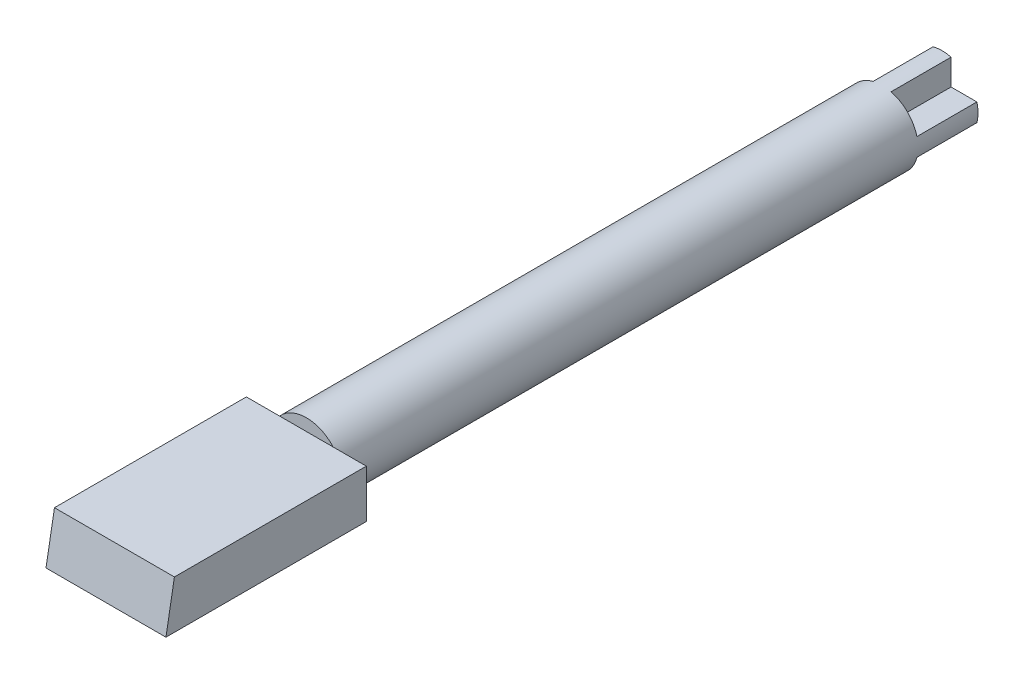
ISO-10303-21;
HEADER;
FILE_DESCRIPTION(('STEP AP214'),'2;1');
FILE_NAME('part.step','',(''),(''),'','','');
FILE_SCHEMA(('AUTOMOTIVE_DESIGN { 1 0 10303 214 1 1 1 1 }'));
ENDSEC;
DATA;
#1=APPLICATION_CONTEXT('core data for automotive mechanical design processes');
#2=APPLICATION_PROTOCOL_DEFINITION('international standard','automotive_design',2000,#1);
#3=PRODUCT_CONTEXT('',#1,'mechanical');
#4=PRODUCT('Part','Part','',(#3));
#5=PRODUCT_RELATED_PRODUCT_CATEGORY('part','',(#4));
#6=PRODUCT_DEFINITION_FORMATION('','',#4);
#7=PRODUCT_DEFINITION_CONTEXT('part definition',#1,'design');
#8=PRODUCT_DEFINITION('design','',#6,#7);
#9=PRODUCT_DEFINITION_SHAPE('','',#8);
#10=(LENGTH_UNIT() NAMED_UNIT(*) SI_UNIT(.MILLI.,.METRE.));
#11=(NAMED_UNIT(*) PLANE_ANGLE_UNIT() SI_UNIT($,.RADIAN.));
#12=(NAMED_UNIT(*) SI_UNIT($,.STERADIAN.) SOLID_ANGLE_UNIT());
#13=UNCERTAINTY_MEASURE_WITH_UNIT(LENGTH_MEASURE(1.E-05),#10,'distance_accuracy_value','');
#14=(GEOMETRIC_REPRESENTATION_CONTEXT(3) GLOBAL_UNCERTAINTY_ASSIGNED_CONTEXT((#13)) GLOBAL_UNIT_ASSIGNED_CONTEXT((#10,
#11,#12)) REPRESENTATION_CONTEXT('',''));
#15=CARTESIAN_POINT('',(0.,0.,0.));
#16=DIRECTION('',(0.,0.,1.));
#17=DIRECTION('',(1.,0.,0.));
#18=AXIS2_PLACEMENT_3D('',#15,#16,#17);
#19=CARTESIAN_POINT('',(0.,0.,0.));
#20=DIRECTION('',(0.,0.,1.));
#21=DIRECTION('',(1.,0.,0.));
#22=AXIS2_PLACEMENT_3D('',#19,#20,#21);
#23=PLANE('',#22);
#24=DIRECTION('',(0.,-1.,0.));
#25=VECTOR('',#24,1.);
#26=CARTESIAN_POINT('',(0.75,0.,0.));
#27=LINE('',#26,#25);
#28=CARTESIAN_POINT('',(0.75,-0.75,0.));
#29=VERTEX_POINT('',#28);
#30=CARTESIAN_POINT('',(0.75,-2.90473750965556,0.));
#31=VERTEX_POINT('',#30);
#32=EDGE_CURVE('E63',#29,#31,#27,.T.);
#33=ORIENTED_EDGE('',*,*,#32,.F.);
#34=DIRECTION('',(1.,0.,0.));
#35=VECTOR('',#34,1.);
#36=CARTESIAN_POINT('',(0.,-0.75,0.));
#37=LINE('',#36,#35);
#38=CARTESIAN_POINT('',(2.90473750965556,-0.75,0.));
#39=VERTEX_POINT('',#38);
#40=EDGE_CURVE('E225',#29,#39,#37,.T.);
#41=ORIENTED_EDGE('',*,*,#40,.T.);
#42=CARTESIAN_POINT('',(0.,0.,0.));
#43=DIRECTION('',(0.,0.,1.));
#44=DIRECTION('',(1.,0.,0.));
#45=AXIS2_PLACEMENT_3D('',#42,#43,#44);
#46=CIRCLE('',#45,3.);
#47=EDGE_CURVE('E284',#31,#39,#46,.T.);
#48=ORIENTED_EDGE('',*,*,#47,.F.);
#49=EDGE_LOOP('',(#33,#41,#48));
#50=FACE_BOUND('',#49,.T.);
#51=ADVANCED_FACE('F36',(#50),#23,.F.);
#52=DIRECTION('',(1.,0.,0.));
#53=VECTOR('',#52,1.);
#54=CARTESIAN_POINT('',(0.,0.75,0.));
#55=LINE('',#54,#53);
#56=CARTESIAN_POINT('',(0.75,0.75,0.));
#57=VERTEX_POINT('',#56);
#58=CARTESIAN_POINT('',(2.90473750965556,0.75,0.));
#59=VERTEX_POINT('',#58);
#60=EDGE_CURVE('E222',#57,#59,#55,.T.);
#61=ORIENTED_EDGE('',*,*,#60,.F.);
#62=DIRECTION('',(0.,-1.,0.));
#63=VECTOR('',#62,1.);
#64=CARTESIAN_POINT('',(0.75,0.,0.));
#65=LINE('',#64,#63);
#66=CARTESIAN_POINT('',(0.75,2.90473750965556,0.));
#67=VERTEX_POINT('',#66);
#68=EDGE_CURVE('E219',#67,#57,#65,.T.);
#69=ORIENTED_EDGE('',*,*,#68,.F.);
#70=EDGE_CURVE('E40',#59,#67,#46,.T.);
#71=ORIENTED_EDGE('',*,*,#70,.F.);
#72=EDGE_LOOP('',(#61,#69,#71));
#73=FACE_BOUND('',#72,.T.);
#74=ADVANCED_FACE('F312',(#73),#23,.F.);
#75=CARTESIAN_POINT('',(-2.90473750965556,-0.75,0.));
#76=VERTEX_POINT('',#75);
#77=CARTESIAN_POINT('',(-0.75,-2.90473750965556,0.));
#78=VERTEX_POINT('',#77);
#79=EDGE_CURVE('E301',#76,#78,#46,.T.);
#80=ORIENTED_EDGE('',*,*,#79,.F.);
#81=DIRECTION('',(1.,0.,0.));
#82=VECTOR('',#81,1.);
#83=CARTESIAN_POINT('',(0.,-0.75,0.));
#84=LINE('',#83,#82);
#85=CARTESIAN_POINT('',(-0.75,-0.75,0.));
#86=VERTEX_POINT('',#85);
#87=EDGE_CURVE('E55',#76,#86,#84,.T.);
#88=ORIENTED_EDGE('',*,*,#87,.T.);
#89=DIRECTION('',(0.,-1.,0.));
#90=VECTOR('',#89,1.);
#91=CARTESIAN_POINT('',(-0.75,0.,0.));
#92=LINE('',#91,#90);
#93=EDGE_CURVE('E188',#86,#78,#92,.T.);
#94=ORIENTED_EDGE('',*,*,#93,.T.);
#95=EDGE_LOOP('',(#80,#88,#94));
#96=FACE_BOUND('',#95,.T.);
#97=ADVANCED_FACE('F309',(#96),#23,.F.);
#98=CARTESIAN_POINT('',(0.,0.,48.));
#99=DIRECTION('',(0.,0.,1.));
#100=DIRECTION('',(1.,0.,0.));
#101=AXIS2_PLACEMENT_3D('',#98,#99,#100);
#102=PLANE('',#101);
#103=CARTESIAN_POINT('',(0.,0.,48.));
#104=DIRECTION('',(0.,0.,1.));
#105=DIRECTION('',(1.,0.,0.));
#106=AXIS2_PLACEMENT_3D('',#103,#104,#105);
#107=CIRCLE('',#106,3.);
#108=CARTESIAN_POINT('',(-2.23606797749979,-2.,48.));
#109=VERTEX_POINT('',#108);
#110=CARTESIAN_POINT('',(2.23606797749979,-2.,48.));
#111=VERTEX_POINT('',#110);
#112=EDGE_CURVE('E294',#109,#111,#107,.T.);
#113=ORIENTED_EDGE('',*,*,#112,.T.);
#114=DIRECTION('',(-1.,0.,0.));
#115=VECTOR('',#114,1.);
#116=CARTESIAN_POINT('',(5.,-2.,48.));
#117=LINE('',#116,#115);
#118=EDGE_CURVE('E45',#111,#109,#117,.T.);
#119=ORIENTED_EDGE('',*,*,#118,.T.);
#120=EDGE_LOOP('',(#113,#119));
#121=FACE_BOUND('',#120,.T.);
#122=ADVANCED_FACE('F311',(#121),#102,.T.);
#123=CARTESIAN_POINT('',(0.,0.,48.));
#124=DIRECTION('',(0.,0.,-1.));
#125=DIRECTION('',(-1.,0.,0.));
#126=AXIS2_PLACEMENT_3D('',#123,#124,#125);
#127=CYLINDRICAL_SURFACE('',#126,3.);
#128=CARTESIAN_POINT('',(2.23606797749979,2.,48.));
#129=VERTEX_POINT('',#128);
#130=CARTESIAN_POINT('',(-2.23606797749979,2.,48.));
#131=VERTEX_POINT('',#130);
#132=EDGE_CURVE('E285',#129,#131,#107,.T.);
#133=ORIENTED_EDGE('',*,*,#132,.F.);
#134=EDGE_CURVE('E288',#111,#129,#107,.T.);
#135=ORIENTED_EDGE('',*,*,#134,.F.);
#136=ORIENTED_EDGE('',*,*,#112,.F.);
#137=EDGE_CURVE('E287',#131,#109,#107,.T.);
#138=ORIENTED_EDGE('',*,*,#137,.F.);
#139=EDGE_LOOP('',(#133,#135,#136,#138));
#140=FACE_BOUND('',#139,.T.);
#141=ORIENTED_EDGE('',*,*,#70,.T.);
#142=DIRECTION('',(0.,0.,1.));
#143=VECTOR('',#142,1.);
#144=CARTESIAN_POINT('',(0.749999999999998,2.90473750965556,-5.));
#145=LINE('',#144,#143);
#146=CARTESIAN_POINT('',(0.749999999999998,2.90473750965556,-5.));
#147=VERTEX_POINT('',#146);
#148=EDGE_CURVE('E246',#147,#67,#145,.T.);
#149=ORIENTED_EDGE('',*,*,#148,.F.);
#150=CARTESIAN_POINT('',(0.,0.,-5.));
#151=DIRECTION('',(0.,0.,-1.));
#152=DIRECTION('',(-1.,0.,0.));
#153=AXIS2_PLACEMENT_3D('',#150,#151,#152);
#154=CIRCLE('',#153,3.);
#155=CARTESIAN_POINT('',(-0.749999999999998,2.90473750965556,-5.));
#156=VERTEX_POINT('',#155);
#157=EDGE_CURVE('E196',#156,#147,#154,.T.);
#158=ORIENTED_EDGE('',*,*,#157,.F.);
#159=DIRECTION('',(0.,0.,1.));
#160=VECTOR('',#159,1.);
#161=CARTESIAN_POINT('',(-0.749999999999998,2.90473750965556,-5.));
#162=LINE('',#161,#160);
#163=CARTESIAN_POINT('',(-0.75,2.90473750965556,0.));
#164=VERTEX_POINT('',#163);
#165=EDGE_CURVE('E249',#156,#164,#162,.T.);
#166=ORIENTED_EDGE('',*,*,#165,.T.);
#167=CARTESIAN_POINT('',(-2.90473750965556,0.75,0.));
#168=VERTEX_POINT('',#167);
#169=EDGE_CURVE('E299',#164,#168,#46,.T.);
#170=ORIENTED_EDGE('',*,*,#169,.T.);
#171=DIRECTION('',(0.,0.,1.));
#172=VECTOR('',#171,1.);
#173=CARTESIAN_POINT('',(-2.90473750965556,0.75,-5.));
#174=LINE('',#173,#172);
#175=CARTESIAN_POINT('',(-2.90473750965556,0.75,-5.));
#176=VERTEX_POINT('',#175);
#177=EDGE_CURVE('E174',#176,#168,#174,.T.);
#178=ORIENTED_EDGE('',*,*,#177,.F.);
#179=CARTESIAN_POINT('',(0.,0.,-5.));
#180=DIRECTION('',(0.,0.,-1.));
#181=DIRECTION('',(-1.,0.,0.));
#182=AXIS2_PLACEMENT_3D('',#179,#180,#181);
#183=CIRCLE('',#182,3.);
#184=CARTESIAN_POINT('',(-2.90473750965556,-0.749999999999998,-5.));
#185=VERTEX_POINT('',#184);
#186=EDGE_CURVE('E177',#185,#176,#183,.T.);
#187=ORIENTED_EDGE('',*,*,#186,.F.);
#188=DIRECTION('',(0.,0.,1.));
#189=VECTOR('',#188,1.);
#190=CARTESIAN_POINT('',(-2.90473750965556,-0.749999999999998,-5.));
#191=LINE('',#190,#189);
#192=EDGE_CURVE('E165',#185,#76,#191,.T.);
#193=ORIENTED_EDGE('',*,*,#192,.T.);
#194=ORIENTED_EDGE('',*,*,#79,.T.);
#195=DIRECTION('',(0.,0.,1.));
#196=VECTOR('',#195,1.);
#197=CARTESIAN_POINT('',(-0.75,-2.90473750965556,-5.));
#198=LINE('',#197,#196);
#199=CARTESIAN_POINT('',(-0.75,-2.90473750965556,-5.));
#200=VERTEX_POINT('',#199);
#201=EDGE_CURVE('E229',#200,#78,#198,.T.);
#202=ORIENTED_EDGE('',*,*,#201,.F.);
#203=CARTESIAN_POINT('',(0.,0.,-5.));
#204=DIRECTION('',(0.,0.,-1.));
#205=DIRECTION('',(-1.,0.,0.));
#206=AXIS2_PLACEMENT_3D('',#203,#204,#205);
#207=CIRCLE('',#206,3.);
#208=CARTESIAN_POINT('',(0.749999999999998,-2.90473750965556,-5.));
#209=VERTEX_POINT('',#208);
#210=EDGE_CURVE('E209',#209,#200,#207,.T.);
#211=ORIENTED_EDGE('',*,*,#210,.F.);
#212=DIRECTION('',(0.,0.,1.));
#213=VECTOR('',#212,1.);
#214=CARTESIAN_POINT('',(0.749999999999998,-2.90473750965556,-5.));
#215=LINE('',#214,#213);
#216=EDGE_CURVE('E232',#209,#31,#215,.T.);
#217=ORIENTED_EDGE('',*,*,#216,.T.);
#218=ORIENTED_EDGE('',*,*,#47,.T.);
#219=DIRECTION('',(0.,0.,1.));
#220=VECTOR('',#219,1.);
#221=CARTESIAN_POINT('',(2.90473750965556,-0.75,-5.));
#222=LINE('',#221,#220);
#223=CARTESIAN_POINT('',(2.90473750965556,-0.75,-5.));
#224=VERTEX_POINT('',#223);
#225=EDGE_CURVE('E237',#224,#39,#222,.T.);
#226=ORIENTED_EDGE('',*,*,#225,.F.);
#227=CARTESIAN_POINT('',(0.,0.,-5.));
#228=DIRECTION('',(0.,0.,-1.));
#229=DIRECTION('',(-1.,0.,0.));
#230=AXIS2_PLACEMENT_3D('',#227,#228,#229);
#231=CIRCLE('',#230,3.);
#232=CARTESIAN_POINT('',(2.90473750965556,0.75,-5.));
#233=VERTEX_POINT('',#232);
#234=EDGE_CURVE('E202',#233,#224,#231,.T.);
#235=ORIENTED_EDGE('',*,*,#234,.F.);
#236=DIRECTION('',(0.,0.,1.));
#237=VECTOR('',#236,1.);
#238=CARTESIAN_POINT('',(2.90473750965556,0.75,-5.));
#239=LINE('',#238,#237);
#240=EDGE_CURVE('E240',#233,#59,#239,.T.);
#241=ORIENTED_EDGE('',*,*,#240,.T.);
#242=EDGE_LOOP('',(#141,#149,#158,#166,#170,#178,#187,#193,#194,#202,#211,#217,#218,#226,#235,#241));
#243=FACE_BOUND('',#242,.T.);
#244=ADVANCED_FACE('F38',(#140,#243),#127,.T.);
#245=DIRECTION('',(-1.,0.,0.));
#246=VECTOR('',#245,1.);
#247=CARTESIAN_POINT('',(5.,2.,48.));
#248=LINE('',#247,#246);
#249=EDGE_CURVE('E11',#129,#131,#248,.T.);
#250=ORIENTED_EDGE('',*,*,#249,.F.);
#251=ORIENTED_EDGE('',*,*,#132,.T.);
#252=EDGE_LOOP('',(#250,#251));
#253=FACE_BOUND('',#252,.T.);
#254=ADVANCED_FACE('F320',(#253),#102,.T.);
#255=ORIENTED_EDGE('',*,*,#169,.F.);
#256=DIRECTION('',(0.,-1.,0.));
#257=VECTOR('',#256,1.);
#258=CARTESIAN_POINT('',(-0.75,0.,0.));
#259=LINE('',#258,#257);
#260=CARTESIAN_POINT('',(-0.75,0.75,0.));
#261=VERTEX_POINT('',#260);
#262=EDGE_CURVE('E217',#164,#261,#259,.T.);
#263=ORIENTED_EDGE('',*,*,#262,.T.);
#264=DIRECTION('',(1.,0.,0.));
#265=VECTOR('',#264,1.);
#266=CARTESIAN_POINT('',(0.,0.75,0.));
#267=LINE('',#266,#265);
#268=EDGE_CURVE('E214',#168,#261,#267,.T.);
#269=ORIENTED_EDGE('',*,*,#268,.F.);
#270=EDGE_LOOP('',(#255,#263,#269));
#271=FACE_BOUND('',#270,.T.);
#272=ADVANCED_FACE('F313',(#271),#23,.F.);
#273=CARTESIAN_POINT('',(5.,-2.,48.));
#274=DIRECTION('',(0.,0.,1.));
#275=DIRECTION('',(1.,0.,0.));
#276=AXIS2_PLACEMENT_3D('',#273,#274,#275);
#277=PLANE('',#276);
#278=CARTESIAN_POINT('',(-5.,2.,48.));
#279=VERTEX_POINT('',#278);
#280=EDGE_CURVE('E48',#131,#279,#248,.T.);
#281=ORIENTED_EDGE('',*,*,#280,.F.);
#282=ORIENTED_EDGE('',*,*,#137,.T.);
#283=CARTESIAN_POINT('',(-5.,-2.,48.));
#284=VERTEX_POINT('',#283);
#285=EDGE_CURVE('E266',#109,#284,#117,.T.);
#286=ORIENTED_EDGE('',*,*,#285,.T.);
#287=DIRECTION('',(0.,1.,0.));
#288=VECTOR('',#287,1.);
#289=CARTESIAN_POINT('',(-5.,-2.,48.));
#290=LINE('',#289,#288);
#291=EDGE_CURVE('E173',#284,#279,#290,.T.);
#292=ORIENTED_EDGE('',*,*,#291,.T.);
#293=EDGE_LOOP('',(#281,#282,#286,#292));
#294=FACE_BOUND('',#293,.T.);
#295=ADVANCED_FACE('F323',(#294),#277,.F.);
#296=CARTESIAN_POINT('',(5.,-2.,48.));
#297=VERTEX_POINT('',#296);
#298=EDGE_CURVE('E275',#297,#111,#117,.T.);
#299=ORIENTED_EDGE('',*,*,#298,.T.);
#300=ORIENTED_EDGE('',*,*,#134,.T.);
#301=CARTESIAN_POINT('',(5.,2.,48.));
#302=VERTEX_POINT('',#301);
#303=EDGE_CURVE('E47',#302,#129,#248,.T.);
#304=ORIENTED_EDGE('',*,*,#303,.F.);
#305=DIRECTION('',(0.,1.,0.));
#306=VECTOR('',#305,1.);
#307=CARTESIAN_POINT('',(5.,-2.,48.));
#308=LINE('',#307,#306);
#309=EDGE_CURVE('E256',#297,#302,#308,.T.);
#310=ORIENTED_EDGE('',*,*,#309,.F.);
#311=EDGE_LOOP('',(#299,#300,#304,#310));
#312=FACE_BOUND('',#311,.T.);
#313=ADVANCED_FACE('F486',(#312),#277,.F.);
#314=CARTESIAN_POINT('',(5.,2.,48.));
#315=DIRECTION('',(0.,-1.,0.));
#316=DIRECTION('',(0.,0.,-1.));
#317=AXIS2_PLACEMENT_3D('',#314,#315,#316);
#318=PLANE('',#317);
#319=DIRECTION('',(0.,0.,1.));
#320=VECTOR('',#319,1.);
#321=CARTESIAN_POINT('',(-5.,2.,48.));
#322=LINE('',#321,#320);
#323=CARTESIAN_POINT('',(-5.,2.,64.));
#324=VERTEX_POINT('',#323);
#325=EDGE_CURVE('E269',#279,#324,#322,.T.);
#326=ORIENTED_EDGE('',*,*,#325,.T.);
#327=DIRECTION('',(-1.,0.,0.));
#328=VECTOR('',#327,1.);
#329=CARTESIAN_POINT('',(5.,2.,64.));
#330=LINE('',#329,#328);
#331=CARTESIAN_POINT('',(5.,2.,64.));
#332=VERTEX_POINT('',#331);
#333=EDGE_CURVE('E281',#332,#324,#330,.T.);
#334=ORIENTED_EDGE('',*,*,#333,.F.);
#335=DIRECTION('',(0.,0.,1.));
#336=VECTOR('',#335,1.);
#337=CARTESIAN_POINT('',(5.,2.,48.));
#338=LINE('',#337,#336);
#339=EDGE_CURVE('E259',#302,#332,#338,.T.);
#340=ORIENTED_EDGE('',*,*,#339,.F.);
#341=ORIENTED_EDGE('',*,*,#303,.T.);
#342=ORIENTED_EDGE('',*,*,#249,.T.);
#343=ORIENTED_EDGE('',*,*,#280,.T.);
#344=EDGE_LOOP('',(#326,#334,#340,#341,#342,#343));
#345=FACE_BOUND('',#344,.T.);
#346=ADVANCED_FACE('F482',(#345),#318,.F.);
#347=CARTESIAN_POINT('',(5.,2.,64.));
#348=DIRECTION('',(0.,-0.173648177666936,-0.984807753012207));
#349=DIRECTION('',(0.,0.984807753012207,-0.173648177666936));
#350=AXIS2_PLACEMENT_3D('',#347,#348,#349);
#351=PLANE('',#350);
#352=DIRECTION('',(0.,-0.984807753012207,0.173648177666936));
#353=VECTOR('',#352,1.);
#354=CARTESIAN_POINT('',(-5.,2.,64.));
#355=LINE('',#354,#353);
#356=CARTESIAN_POINT('',(-5.,-2.,64.7053079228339));
#357=VERTEX_POINT('',#356);
#358=EDGE_CURVE('E271',#324,#357,#355,.T.);
#359=ORIENTED_EDGE('',*,*,#358,.T.);
#360=DIRECTION('',(-1.,0.,0.));
#361=VECTOR('',#360,1.);
#362=CARTESIAN_POINT('',(5.,-2.,64.7053079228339));
#363=LINE('',#362,#361);
#364=CARTESIAN_POINT('',(5.,-2.,64.7053079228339));
#365=VERTEX_POINT('',#364);
#366=EDGE_CURVE('E278',#365,#357,#363,.T.);
#367=ORIENTED_EDGE('',*,*,#366,.F.);
#368=DIRECTION('',(0.,-0.984807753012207,0.173648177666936));
#369=VECTOR('',#368,1.);
#370=CARTESIAN_POINT('',(5.,2.,64.));
#371=LINE('',#370,#369);
#372=EDGE_CURVE('E262',#332,#365,#371,.T.);
#373=ORIENTED_EDGE('',*,*,#372,.F.);
#374=ORIENTED_EDGE('',*,*,#333,.T.);
#375=EDGE_LOOP('',(#359,#367,#373,#374));
#376=FACE_BOUND('',#375,.T.);
#377=ADVANCED_FACE('F478',(#376),#351,.F.);
#378=CARTESIAN_POINT('',(5.,-2.,64.7053079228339));
#379=DIRECTION('',(0.,1.,0.));
#380=DIRECTION('',(0.,0.,1.));
#381=AXIS2_PLACEMENT_3D('',#378,#379,#380);
#382=PLANE('',#381);
#383=DIRECTION('',(0.,0.,-1.));
#384=VECTOR('',#383,1.);
#385=CARTESIAN_POINT('',(-5.,-2.,64.7053079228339));
#386=LINE('',#385,#384);
#387=EDGE_CURVE('E260',#357,#284,#386,.T.);
#388=ORIENTED_EDGE('',*,*,#387,.T.);
#389=ORIENTED_EDGE('',*,*,#285,.F.);
#390=ORIENTED_EDGE('',*,*,#118,.F.);
#391=ORIENTED_EDGE('',*,*,#298,.F.);
#392=DIRECTION('',(0.,0.,-1.));
#393=VECTOR('',#392,1.);
#394=CARTESIAN_POINT('',(5.,-2.,64.7053079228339));
#395=LINE('',#394,#393);
#396=EDGE_CURVE('E264',#365,#297,#395,.T.);
#397=ORIENTED_EDGE('',*,*,#396,.F.);
#398=ORIENTED_EDGE('',*,*,#366,.T.);
#399=EDGE_LOOP('',(#388,#389,#390,#391,#397,#398));
#400=FACE_BOUND('',#399,.T.);
#401=ADVANCED_FACE('F472',(#400),#382,.F.);
#402=CARTESIAN_POINT('',(5.,0.,0.));
#403=DIRECTION('',(1.,0.,0.));
#404=DIRECTION('',(0.,0.,-1.));
#405=AXIS2_PLACEMENT_3D('',#402,#403,#404);
#406=PLANE('',#405);
#407=ORIENTED_EDGE('',*,*,#309,.T.);
#408=ORIENTED_EDGE('',*,*,#339,.T.);
#409=ORIENTED_EDGE('',*,*,#372,.T.);
#410=ORIENTED_EDGE('',*,*,#396,.T.);
#411=EDGE_LOOP('',(#407,#408,#409,#410));
#412=FACE_BOUND('',#411,.T.);
#413=ADVANCED_FACE('F469',(#412),#406,.T.);
#414=CARTESIAN_POINT('',(-5.,0.,0.));
#415=DIRECTION('',(1.,0.,0.));
#416=DIRECTION('',(0.,0.,-1.));
#417=AXIS2_PLACEMENT_3D('',#414,#415,#416);
#418=PLANE('',#417);
#419=ORIENTED_EDGE('',*,*,#291,.F.);
#420=ORIENTED_EDGE('',*,*,#387,.F.);
#421=ORIENTED_EDGE('',*,*,#358,.F.);
#422=ORIENTED_EDGE('',*,*,#325,.F.);
#423=EDGE_LOOP('',(#419,#420,#421,#422));
#424=FACE_BOUND('',#423,.T.);
#425=ADVANCED_FACE('F367',(#424),#418,.F.);
#426=CARTESIAN_POINT('',(0.,-0.75,-5.));
#427=DIRECTION('',(0.,-1.,0.));
#428=DIRECTION('',(0.,0.,-1.));
#429=AXIS2_PLACEMENT_3D('',#426,#427,#428);
#430=PLANE('',#429);
#431=ORIENTED_EDGE('',*,*,#87,.F.);
#432=ORIENTED_EDGE('',*,*,#192,.F.);
#433=DIRECTION('',(1.,0.,0.));
#434=VECTOR('',#433,1.);
#435=CARTESIAN_POINT('',(0.,-0.75,-5.));
#436=LINE('',#435,#434);
#437=CARTESIAN_POINT('',(-0.75,-0.75,-5.));
#438=VERTEX_POINT('',#437);
#439=EDGE_CURVE('E169',#185,#438,#436,.T.);
#440=ORIENTED_EDGE('',*,*,#439,.T.);
#441=DIRECTION('',(0.,0.,1.));
#442=VECTOR('',#441,1.);
#443=CARTESIAN_POINT('',(-0.75,-0.75,-5.));
#444=LINE('',#443,#442);
#445=EDGE_CURVE('E212',#438,#86,#444,.T.);
#446=ORIENTED_EDGE('',*,*,#445,.T.);
#447=EDGE_LOOP('',(#431,#432,#440,#446));
#448=FACE_BOUND('',#447,.T.);
#449=ADVANCED_FACE('F167',(#448),#430,.T.);
#450=CARTESIAN_POINT('',(0.,0.75,-5.));
#451=DIRECTION('',(0.,-1.,0.));
#452=DIRECTION('',(0.,0.,-1.));
#453=AXIS2_PLACEMENT_3D('',#450,#451,#452);
#454=PLANE('',#453);
#455=ORIENTED_EDGE('',*,*,#268,.T.);
#456=DIRECTION('',(0.,0.,1.));
#457=VECTOR('',#456,1.);
#458=CARTESIAN_POINT('',(-0.75,0.75,-5.));
#459=LINE('',#458,#457);
#460=CARTESIAN_POINT('',(-0.75,0.75,-5.));
#461=VERTEX_POINT('',#460);
#462=EDGE_CURVE('E252',#461,#261,#459,.T.);
#463=ORIENTED_EDGE('',*,*,#462,.F.);
#464=DIRECTION('',(1.,0.,0.));
#465=VECTOR('',#464,1.);
#466=CARTESIAN_POINT('',(0.,0.75,-5.));
#467=LINE('',#466,#465);
#468=EDGE_CURVE('E183',#176,#461,#467,.T.);
#469=ORIENTED_EDGE('',*,*,#468,.F.);
#470=ORIENTED_EDGE('',*,*,#177,.T.);
#471=EDGE_LOOP('',(#455,#463,#469,#470));
#472=FACE_BOUND('',#471,.T.);
#473=ADVANCED_FACE('F366',(#472),#454,.F.);
#474=CARTESIAN_POINT('',(-0.75,0.,-5.));
#475=DIRECTION('',(-1.,0.,0.));
#476=DIRECTION('',(0.,0.,1.));
#477=AXIS2_PLACEMENT_3D('',#474,#475,#476);
#478=PLANE('',#477);
#479=ORIENTED_EDGE('',*,*,#262,.F.);
#480=ORIENTED_EDGE('',*,*,#165,.F.);
#481=DIRECTION('',(0.,-1.,0.));
#482=VECTOR('',#481,1.);
#483=CARTESIAN_POINT('',(-0.75,0.,-5.));
#484=LINE('',#483,#482);
#485=EDGE_CURVE('E193',#156,#461,#484,.T.);
#486=ORIENTED_EDGE('',*,*,#485,.T.);
#487=ORIENTED_EDGE('',*,*,#462,.T.);
#488=EDGE_LOOP('',(#479,#480,#486,#487));
#489=FACE_BOUND('',#488,.T.);
#490=ADVANCED_FACE('F377',(#489),#478,.T.);
#491=CARTESIAN_POINT('',(0.75,0.,-5.));
#492=DIRECTION('',(-1.,0.,0.));
#493=DIRECTION('',(0.,0.,1.));
#494=AXIS2_PLACEMENT_3D('',#491,#492,#493);
#495=PLANE('',#494);
#496=ORIENTED_EDGE('',*,*,#68,.T.);
#497=DIRECTION('',(0.,0.,1.));
#498=VECTOR('',#497,1.);
#499=CARTESIAN_POINT('',(0.75,0.75,-5.));
#500=LINE('',#499,#498);
#501=CARTESIAN_POINT('',(0.75,0.75,-5.));
#502=VERTEX_POINT('',#501);
#503=EDGE_CURVE('E243',#502,#57,#500,.T.);
#504=ORIENTED_EDGE('',*,*,#503,.F.);
#505=DIRECTION('',(0.,-1.,0.));
#506=VECTOR('',#505,1.);
#507=CARTESIAN_POINT('',(0.75,0.,-5.));
#508=LINE('',#507,#506);
#509=EDGE_CURVE('E198',#147,#502,#508,.T.);
#510=ORIENTED_EDGE('',*,*,#509,.F.);
#511=ORIENTED_EDGE('',*,*,#148,.T.);
#512=EDGE_LOOP('',(#496,#504,#510,#511));
#513=FACE_BOUND('',#512,.T.);
#514=ADVANCED_FACE('F387',(#513),#495,.F.);
#515=CARTESIAN_POINT('',(0.,0.75,-5.));
#516=DIRECTION('',(0.,-1.,0.));
#517=DIRECTION('',(0.,0.,-1.));
#518=AXIS2_PLACEMENT_3D('',#515,#516,#517);
#519=PLANE('',#518);
#520=ORIENTED_EDGE('',*,*,#60,.T.);
#521=ORIENTED_EDGE('',*,*,#240,.F.);
#522=DIRECTION('',(1.,0.,0.));
#523=VECTOR('',#522,1.);
#524=CARTESIAN_POINT('',(0.,0.75,-5.));
#525=LINE('',#524,#523);
#526=EDGE_CURVE('E200',#502,#233,#525,.T.);
#527=ORIENTED_EDGE('',*,*,#526,.F.);
#528=ORIENTED_EDGE('',*,*,#503,.T.);
#529=EDGE_LOOP('',(#520,#521,#527,#528));
#530=FACE_BOUND('',#529,.T.);
#531=ADVANCED_FACE('F397',(#530),#519,.F.);
#532=CARTESIAN_POINT('',(0.,-0.75,-5.));
#533=DIRECTION('',(0.,-1.,0.));
#534=DIRECTION('',(0.,0.,-1.));
#535=AXIS2_PLACEMENT_3D('',#532,#533,#534);
#536=PLANE('',#535);
#537=ORIENTED_EDGE('',*,*,#40,.F.);
#538=DIRECTION('',(0.,0.,1.));
#539=VECTOR('',#538,1.);
#540=CARTESIAN_POINT('',(0.75,-0.75,-5.));
#541=LINE('',#540,#539);
#542=CARTESIAN_POINT('',(0.75,-0.75,-5.));
#543=VERTEX_POINT('',#542);
#544=EDGE_CURVE('E235',#543,#29,#541,.T.);
#545=ORIENTED_EDGE('',*,*,#544,.F.);
#546=DIRECTION('',(1.,0.,0.));
#547=VECTOR('',#546,1.);
#548=CARTESIAN_POINT('',(0.,-0.75,-5.));
#549=LINE('',#548,#547);
#550=EDGE_CURVE('E204',#543,#224,#549,.T.);
#551=ORIENTED_EDGE('',*,*,#550,.T.);
#552=ORIENTED_EDGE('',*,*,#225,.T.);
#553=EDGE_LOOP('',(#537,#545,#551,#552));
#554=FACE_BOUND('',#553,.T.);
#555=ADVANCED_FACE('F407',(#554),#536,.T.);
#556=CARTESIAN_POINT('',(0.75,0.,-5.));
#557=DIRECTION('',(-1.,0.,0.));
#558=DIRECTION('',(0.,0.,1.));
#559=AXIS2_PLACEMENT_3D('',#556,#557,#558);
#560=PLANE('',#559);
#561=ORIENTED_EDGE('',*,*,#32,.T.);
#562=ORIENTED_EDGE('',*,*,#216,.F.);
#563=DIRECTION('',(0.,-1.,0.));
#564=VECTOR('',#563,1.);
#565=CARTESIAN_POINT('',(0.75,0.,-5.));
#566=LINE('',#565,#564);
#567=EDGE_CURVE('E207',#543,#209,#566,.T.);
#568=ORIENTED_EDGE('',*,*,#567,.F.);
#569=ORIENTED_EDGE('',*,*,#544,.T.);
#570=EDGE_LOOP('',(#561,#562,#568,#569));
#571=FACE_BOUND('',#570,.T.);
#572=ADVANCED_FACE('F417',(#571),#560,.F.);
#573=CARTESIAN_POINT('',(-0.75,0.,-5.));
#574=DIRECTION('',(-1.,0.,0.));
#575=DIRECTION('',(0.,0.,1.));
#576=AXIS2_PLACEMENT_3D('',#573,#574,#575);
#577=PLANE('',#576);
#578=ORIENTED_EDGE('',*,*,#93,.F.);
#579=ORIENTED_EDGE('',*,*,#445,.F.);
#580=DIRECTION('',(0.,-1.,0.));
#581=VECTOR('',#580,1.);
#582=CARTESIAN_POINT('',(-0.75,0.,-5.));
#583=LINE('',#582,#581);
#584=EDGE_CURVE('E187',#438,#200,#583,.T.);
#585=ORIENTED_EDGE('',*,*,#584,.T.);
#586=ORIENTED_EDGE('',*,*,#201,.T.);
#587=EDGE_LOOP('',(#578,#579,#585,#586));
#588=FACE_BOUND('',#587,.T.);
#589=ADVANCED_FACE('F308',(#588),#577,.T.);
#590=CARTESIAN_POINT('',(0.,0.,-5.));
#591=DIRECTION('',(0.,0.,-1.));
#592=DIRECTION('',(-1.,0.,0.));
#593=AXIS2_PLACEMENT_3D('',#590,#591,#592);
#594=PLANE('',#593);
#595=ORIENTED_EDGE('',*,*,#439,.F.);
#596=ORIENTED_EDGE('',*,*,#186,.T.);
#597=ORIENTED_EDGE('',*,*,#468,.T.);
#598=ORIENTED_EDGE('',*,*,#485,.F.);
#599=ORIENTED_EDGE('',*,*,#157,.T.);
#600=ORIENTED_EDGE('',*,*,#509,.T.);
#601=ORIENTED_EDGE('',*,*,#526,.T.);
#602=ORIENTED_EDGE('',*,*,#234,.T.);
#603=ORIENTED_EDGE('',*,*,#550,.F.);
#604=ORIENTED_EDGE('',*,*,#567,.T.);
#605=ORIENTED_EDGE('',*,*,#210,.T.);
#606=ORIENTED_EDGE('',*,*,#584,.F.);
#607=EDGE_LOOP('',(#595,#596,#597,#598,#599,#600,#601,#602,#603,#604,#605,#606));
#608=FACE_BOUND('',#607,.T.);
#609=ADVANCED_FACE('F185',(#608),#594,.T.);
#610=CLOSED_SHELL('',(#51,#74,#97,#122,#244,#254,#272,#295,#313,#346,#377,#401,#413,#425,#449,
#473,#490,#514,#531,#555,#572,#589,#609));
#611=MANIFOLD_SOLID_BREP('B2',#610);
#612=ADVANCED_BREP_SHAPE_REPRESENTATION('',(#18,#611),#14);
#613=SHAPE_DEFINITION_REPRESENTATION(#9,#612);
ENDSEC;
END-ISO-10303-21;
